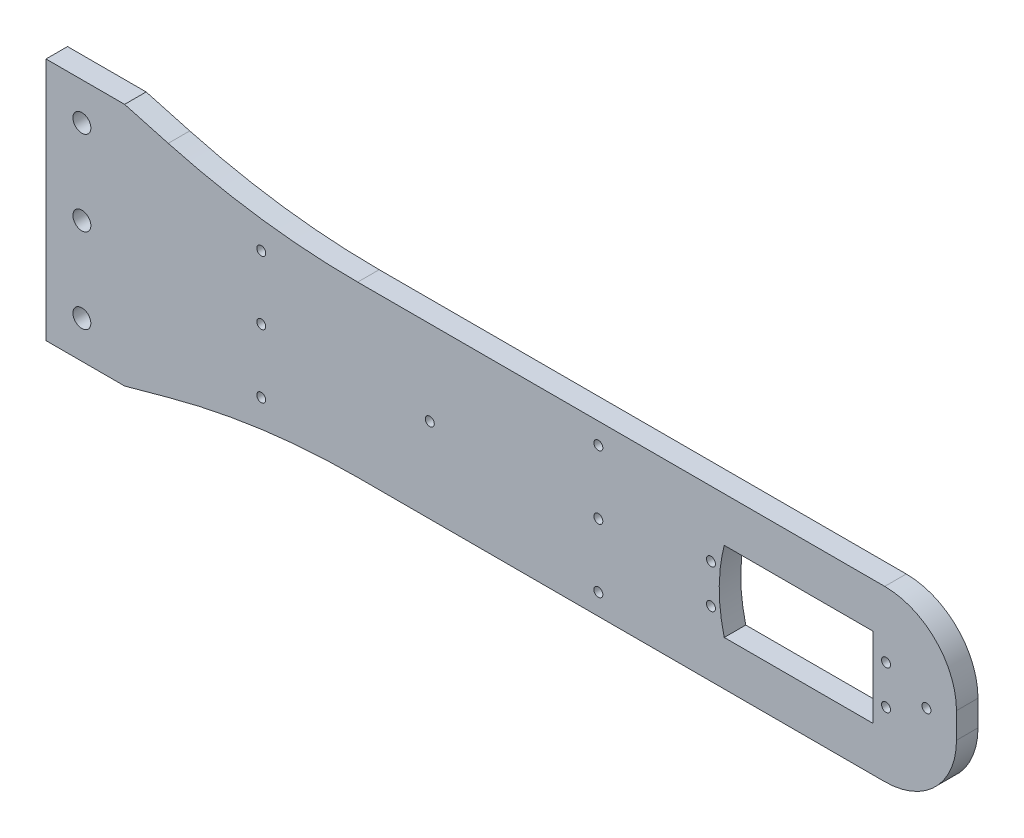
from build123d import *

# Parameters (mm, degrees)
SKETCH1_R           = 2.5
SKETCH1_R_2         = 1.25
BOSS_EXTRUDE2_DEPTH = 6
CUT_EXTRUDE1_DEPTH  = 6


with BuildPart() as part:
    # Sketch1 → Boss-Extrude2 (new body)
    with BuildSketch(Plane.XY):
        with BuildLine():
            Line((-180.869137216, 41.700715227), (-214.942156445, 51.028361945))
            Line((-214.942156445, 51.028361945), (-214.942156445, -28.971638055))
            Line((-214.942156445, -28.971638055), (-180.869137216, -19.643991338))
            ThreePointArc((-180.869137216, -19.643991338), (-154.702600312, -14.328710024), (-128.061220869, -12.546360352))
            Line((-128.061220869, -12.546360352), (18.853563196, -12.546360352))
            ThreePointArc((18.853563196, -12.546360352), (32.99569882, -6.688495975), (38.853563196, 7.453639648))
            Line((38.853563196, 7.453639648), (38.853563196, 14.603084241))
            ThreePointArc((38.853563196, 14.603084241), (32.99569882, 28.745219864), (18.853563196, 34.603084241))
            Line((18.853563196, 34.603084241), (-128.061220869, 34.603084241))
            ThreePointArc((-128.061220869, 34.603084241), (-154.702600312, 36.385433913), (-180.869137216, 41.700715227))
        make_face()
        with Locations((-204.942156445, -12.546360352)):
            Circle(SKETCH1_R, mode=Mode.SUBTRACT)
        with Locations((-154.942156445, -6.688495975)):
            Circle(SKETCH1_R_2, mode=Mode.SUBTRACT)
        with Locations((-60.973228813, -6.688495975)):
            Circle(SKETCH1_R_2, mode=Mode.SUBTRACT)
        with Locations((-29.582156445, 5.633361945)):
            Circle(SKETCH1_R_2, mode=Mode.SUBTRACT)
        with Locations((19.217843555, 5.633361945)):
            Circle(SKETCH1_R_2, mode=Mode.SUBTRACT)
        with Locations((-204.942156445, 11.028361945)):
            Circle(SKETCH1_R, mode=Mode.SUBTRACT)
        with Locations((-154.942156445, 11.028361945)):
            Circle(SKETCH1_R_2, mode=Mode.SUBTRACT)
        with Locations((-154.942156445, 28.745219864)):
            Circle(SKETCH1_R_2, mode=Mode.SUBTRACT)
        with Locations((-107.957692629, 11.028361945)):
            Circle(SKETCH1_R_2, mode=Mode.SUBTRACT)
        with Locations((-204.942156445, 34.603084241)):
            Circle(SKETCH1_R, mode=Mode.SUBTRACT)
        with Locations((-60.973228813, 11.028361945)):
            Circle(SKETCH1_R_2, mode=Mode.SUBTRACT)
        with Locations((-29.582156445, 16.423361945)):
            Circle(SKETCH1_R_2, mode=Mode.SUBTRACT)
        with Locations((-60.973228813, 28.745219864)):
            Circle(SKETCH1_R_2, mode=Mode.SUBTRACT)
        with BuildLine():
            Line((15.517843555, 22.153361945), (15.517843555, -0.096638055))
            Line((15.517843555, -0.096638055), (-25.882156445, -0.096638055))
            add(Edge.make_bspline(
                [(-25.882156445, -0.096638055), (-28.687542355, 11.028361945), (-25.882156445, 22.153361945)],
                knots=[0, 0, 0, 1, 1, 1], degree=2))
            Line((-25.882156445, 22.153361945), (15.517843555, 22.153361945))
        make_face(mode=Mode.SUBTRACT)
        with Locations((30.478979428, 11.028361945)):
            Circle(SKETCH1_R_2, mode=Mode.SUBTRACT)
        with Locations((19.217843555, 16.423361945)):
            Circle(SKETCH1_R_2, mode=Mode.SUBTRACT)
    extrude(amount=BOSS_EXTRUDE2_DEPTH)

    # Sketch2 → Cut-Extrude1 (cut)
    with BuildSketch(Plane(origin=(0, 0, 0), x_dir=(-1, 0, 0), z_dir=(0, 0, -1))):
        Polygon((214.942156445, -22.971938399), (193.025815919, -22.971938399), (214.942156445, -28.971638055), align=None)
        Polygon((214.942156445, 45.028662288), (193.025815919, 45.028662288), (214.942156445, 51.028361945), align=None)
    extrude(amount=-CUT_EXTRUDE1_DEPTH, mode=Mode.SUBTRACT)


solid = part.part
